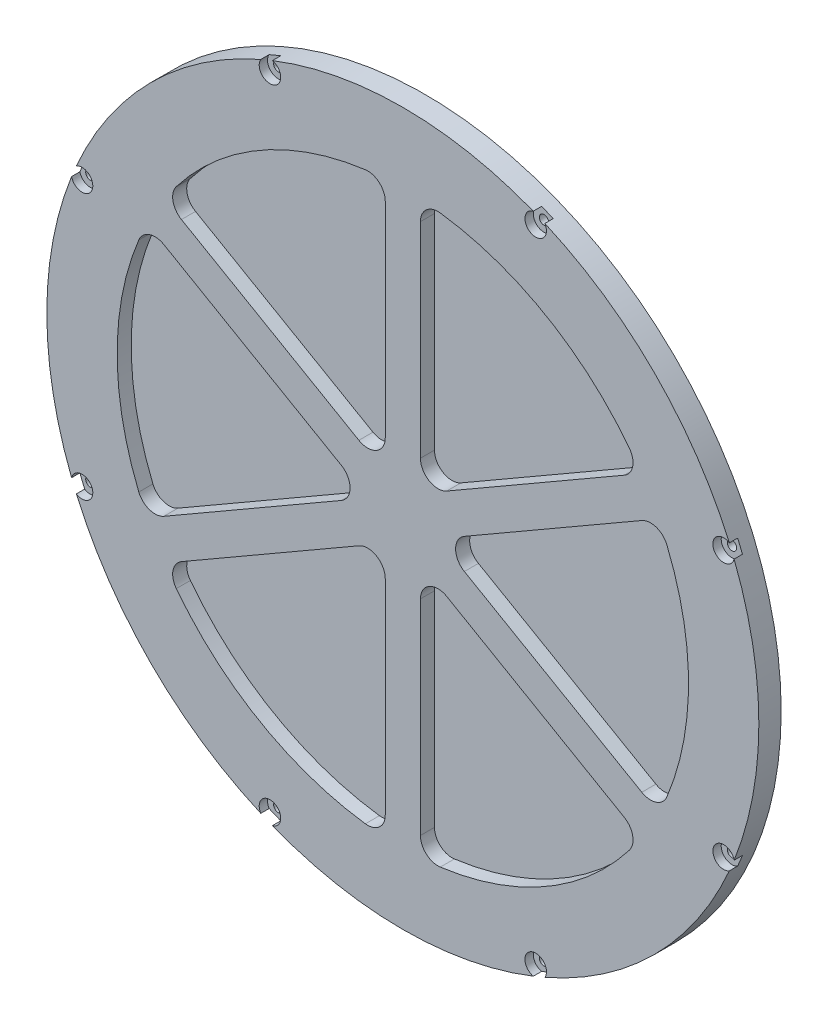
from build123d import *

# Parameters (mm, degrees)
SKETCH1_R                               = 202.5
BOSS_EXTRUDE1_DEPTH                     = 6.35
CBORE_FOR_M5_HEX_HEAD_BOLT1_D           = 5.3
CBORE_FOR_M5_HEX_HEAD_BOLT1_CBORE_D     = 12.24
CBORE_FOR_M5_HEX_HEAD_BOLT1_CBORE_DEPTH = 4.74
CUT_EXTRUDE4_DEPTH                      = 8
CIRPATTERN1_COUNT                       = 8


with BuildPart() as part:
    # Sketch1 → Boss-Extrude1 (new, symmetric)
    with BuildSketch(Plane.XY):
        Circle(SKETCH1_R)
    extrude(amount=BOSS_EXTRUDE1_DEPTH, both=True)

    # CBORE for M5 Hex Head Bolt1 (through all)
    with Locations(Plane(origin=(-75.579977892, 182.466207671, 6.35), x_dir=(1, 0, 0), z_dir=(0, 0, 1))):
        with Locations((0, 0)):
            cbore_for_m5_hex_head_bolt1 = CounterBoreHole(CBORE_FOR_M5_HEX_HEAD_BOLT1_D / 2, CBORE_FOR_M5_HEX_HEAD_BOLT1_CBORE_D / 2, CBORE_FOR_M5_HEX_HEAD_BOLT1_CBORE_DEPTH)

    # Sketch13 → Cut-Extrude4 (cut)
    with BuildSketch(Plane.XY.offset(6.35)):
        with BuildLine():
            Line((10, 151.182836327), (10, 34.641016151))
            ThreePointArc((10, 34.641016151), (15, 25.980762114), (25, 25.980762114))
            Line((25, 25.980762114), (125.928176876, 84.251672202))
            ThreePointArc((125.928176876, 84.251672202), (130.736640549, 90.964096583), (128.857893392, 99.004511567))
            ThreePointArc((128.857893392, 99.004511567), (81.25, 140.729128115), (21.31147541, 161.096464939))
            ThreePointArc((21.31147541, 161.096464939), (13.408898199, 158.703300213), (10, 151.182836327))
        make_face()
        with BuildLine():
            Line((-10, 151.182836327), (-10, 34.641016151))
            ThreePointArc((-10, 34.641016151), (-15, 25.980762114), (-25, 25.980762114))
            Line((-25, 25.980762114), (-125.928176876, 84.251672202))
            ThreePointArc((-125.928176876, 84.251672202), (-130.736640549, 90.964096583), (-128.857893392, 99.004511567))
            ThreePointArc((-128.857893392, 99.004511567), (-81.25, 140.729128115), (-21.31147541, 161.096464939))
            ThreePointArc((-21.31147541, 161.096464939), (-13.408898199, 158.703300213), (-10, 151.182836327))
        make_face()
        with BuildLine():
            Line((125.928176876, -84.251672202), (25, -25.980762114))
            ThreePointArc((25, -25.980762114), (15, -25.980762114), (10, -34.641016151))
            Line((10, -34.641016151), (10, -151.182836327))
            ThreePointArc((10, -151.182836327), (13.408898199, -158.703300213), (21.31147541, -161.096464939))
            ThreePointArc((21.31147541, -161.096464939), (81.25, -140.729128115), (128.857893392, -99.004511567))
            ThreePointArc((128.857893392, -99.004511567), (130.736640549, -90.964096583), (125.928176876, -84.251672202))
        make_face()
        with BuildLine():
            Line((-125.928176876, -84.251672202), (-25, -25.980762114))
            ThreePointArc((-25, -25.980762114), (-15, -25.980762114), (-10, -34.641016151))
            Line((-10, -34.641016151), (-10, -151.182836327))
            ThreePointArc((-10, -151.182836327), (-13.408898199, -158.703300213), (-21.31147541, -161.096464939))
            ThreePointArc((-21.31147541, -161.096464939), (-81.25, -140.729128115), (-128.857893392, -99.004511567))
            ThreePointArc((-128.857893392, -99.004511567), (-130.736640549, -90.964096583), (-125.928176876, -84.251672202))
        make_face()
        with BuildLine():
            Line((-35, -8.660254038), (-135.928176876, -66.931164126))
            ThreePointArc((-135.928176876, -66.931164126), (-144.145538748, -67.739203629), (-150.169368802, -62.091953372))
            ThreePointArc((-150.169368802, -62.091953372), (-162.5, 0), (-150.169368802, 62.091953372))
            ThreePointArc((-150.169368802, 62.091953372), (-144.145538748, 67.739203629), (-135.928176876, 66.931164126))
            Line((-135.928176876, 66.931164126), (-35, 8.660254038))
            ThreePointArc((-35, 8.660254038), (-30, 0), (-35, -8.660254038))
        make_face()
        with BuildLine():
            Line((35, -8.660254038), (135.928176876, -66.931164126))
            ThreePointArc((135.928176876, -66.931164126), (144.145538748, -67.739203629), (150.169368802, -62.091953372))
            ThreePointArc((150.169368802, -62.091953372), (162.5, 0), (150.169368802, 62.091953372))
            ThreePointArc((150.169368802, 62.091953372), (144.145538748, 67.739203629), (135.928176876, 66.931164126))
            Line((135.928176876, 66.931164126), (35, 8.660254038))
            ThreePointArc((35, 8.660254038), (30, 0), (35, -8.660254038))
        make_face()
    extrude(amount=-CUT_EXTRUDE4_DEPTH, mode=Mode.SUBTRACT)

    # CirPattern1: CBORE for M5 Hex Head Bolt1 ×8 about axis
    cirpattern1_axis = Axis((0, 0, 0), (0, 0, 1))
    for i in range(1, CIRPATTERN1_COUNT):
        add(cbore_for_m5_hex_head_bolt1.rotate(cirpattern1_axis, i * 360 / CIRPATTERN1_COUNT), mode=Mode.SUBTRACT)


solid = part.part
